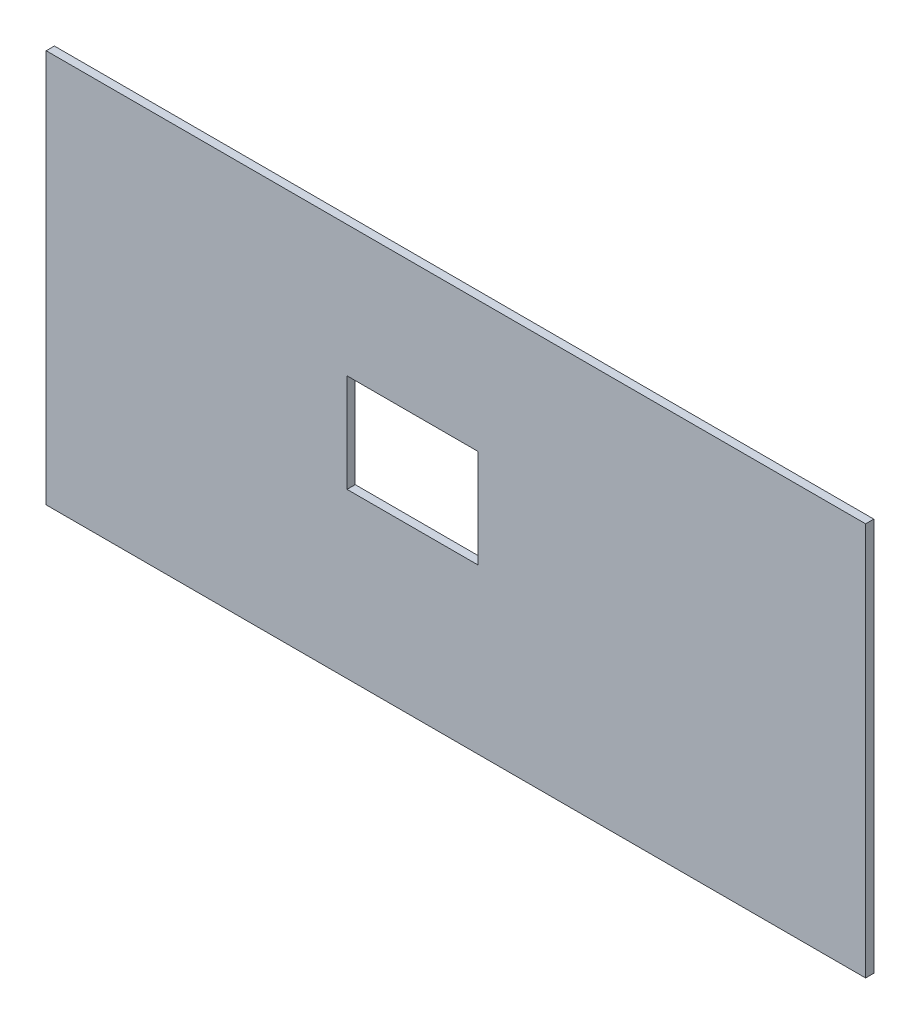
from build123d import *

# Parameters (mm, degrees)
SKETCH1_W           = 635
SKETCH1_H           = 304.8
SKETCH1_W_2         = 101.6
SKETCH1_H_2         = 76.2
BOSS_EXTRUDE2_DEPTH = 6.35


with BuildPart() as part:
    # Sketch1 → Boss-Extrude2 (new body)
    with BuildSketch(Plane.XY):
        with Locations((281.758359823, 247.981926)):
            Rectangle(SKETCH1_W, SKETCH1_H)
        with Locations((248.209000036, 260.681926)):
            Rectangle(SKETCH1_W_2, SKETCH1_H_2, mode=Mode.SUBTRACT)
    extrude(amount=BOSS_EXTRUDE2_DEPTH)


solid = part.part
